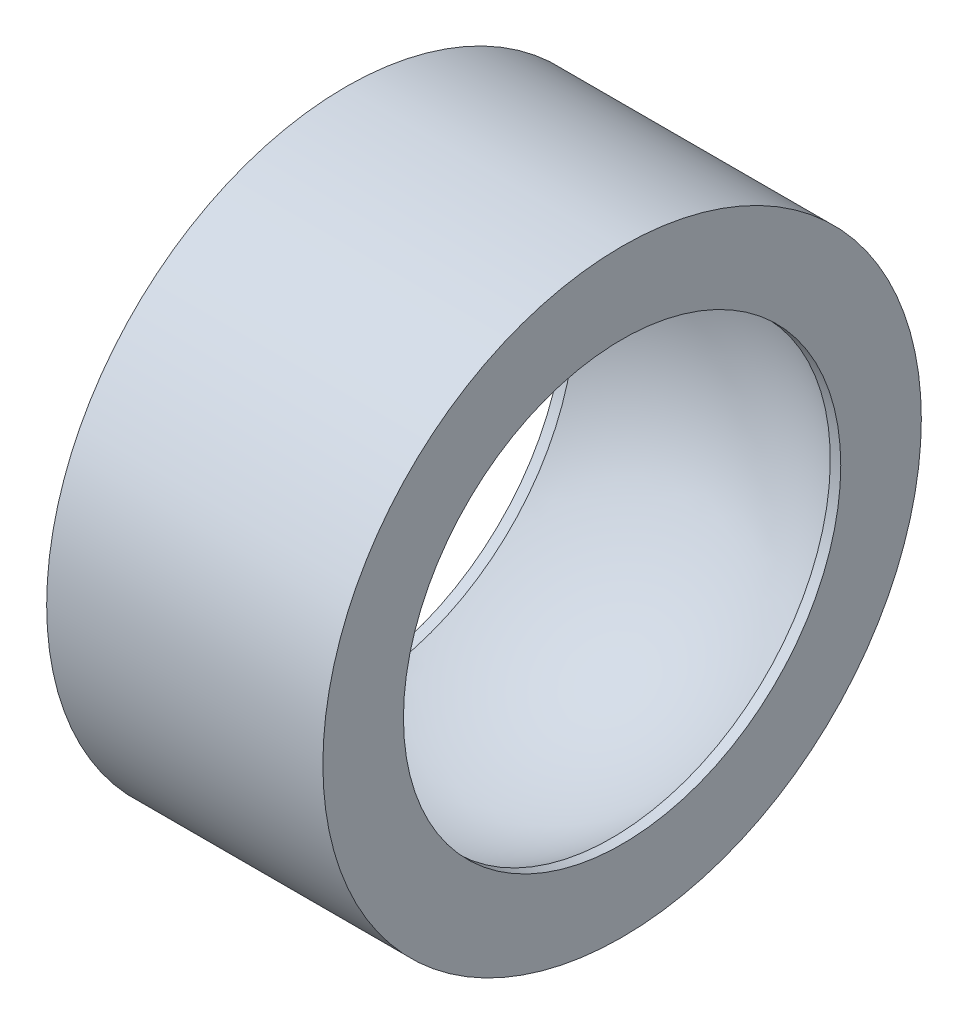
from build123d import *


with BuildPart() as part:
    # Esquisse1 → Base-R_volution (revolve)
    with BuildSketch(Plane.XY, mode=Mode.PRIVATE) as base_r_volution_sk:
        with BuildLine():
            Line((11.545268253, 9.5), (12, 9.5))
            Line((12, 9.5), (12, 13))
            Line((12, 13), (0, 13))
            Line((0, 13), (0, 9.5))
            Line((0, 9.5), (0.454731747, 9.5))
            ThreePointArc((0.454731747, 9.5), (6, 11), (11.545268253, 9.5))
        make_face()
    revolve(base_r_volution_sk.sketch.rotate(Axis((0, 0, 0), (1, 0, 0)), 90), axis=Axis((0, 0, 0), (1, 0, 0)))


solid = part.part
